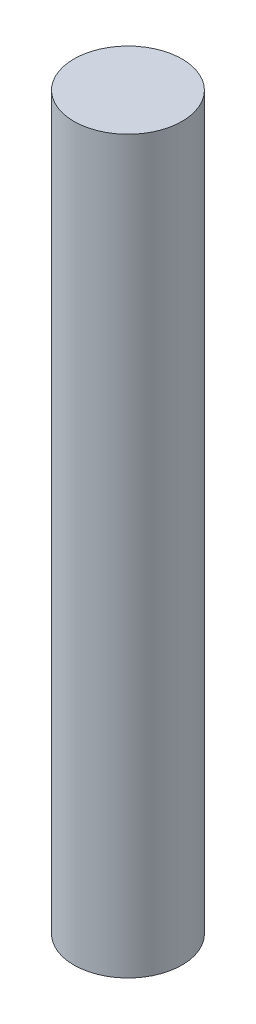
ISO-10303-21;
HEADER;
FILE_DESCRIPTION(('STEP AP214'),'2;1');
FILE_NAME('part.step','',(''),(''),'','','');
FILE_SCHEMA(('AUTOMOTIVE_DESIGN { 1 0 10303 214 1 1 1 1 }'));
ENDSEC;
DATA;
#1=APPLICATION_CONTEXT('core data for automotive mechanical design processes');
#2=APPLICATION_PROTOCOL_DEFINITION('international standard','automotive_design',2000,#1);
#3=PRODUCT_CONTEXT('',#1,'mechanical');
#4=PRODUCT('Part','Part','',(#3));
#5=PRODUCT_RELATED_PRODUCT_CATEGORY('part','',(#4));
#6=PRODUCT_DEFINITION_FORMATION('','',#4);
#7=PRODUCT_DEFINITION_CONTEXT('part definition',#1,'design');
#8=PRODUCT_DEFINITION('design','',#6,#7);
#9=PRODUCT_DEFINITION_SHAPE('','',#8);
#10=(LENGTH_UNIT() NAMED_UNIT(*) SI_UNIT(.MILLI.,.METRE.));
#11=(NAMED_UNIT(*) PLANE_ANGLE_UNIT() SI_UNIT($,.RADIAN.));
#12=(NAMED_UNIT(*) SI_UNIT($,.STERADIAN.) SOLID_ANGLE_UNIT());
#13=UNCERTAINTY_MEASURE_WITH_UNIT(LENGTH_MEASURE(1.E-05),#10,'distance_accuracy_value','');
#14=(GEOMETRIC_REPRESENTATION_CONTEXT(3) GLOBAL_UNCERTAINTY_ASSIGNED_CONTEXT((#13)) GLOBAL_UNIT_ASSIGNED_CONTEXT((#10,
#11,#12)) REPRESENTATION_CONTEXT('',''));
#15=CARTESIAN_POINT('',(0.,0.,0.));
#16=DIRECTION('',(0.,0.,1.));
#17=DIRECTION('',(1.,0.,0.));
#18=AXIS2_PLACEMENT_3D('',#15,#16,#17);
#19=CARTESIAN_POINT('',(0.,25.,0.));
#20=DIRECTION('',(0.,-1.,0.));
#21=DIRECTION('',(0.,0.,-1.));
#22=AXIS2_PLACEMENT_3D('',#19,#20,#21);
#23=CYLINDRICAL_SURFACE('',#22,1.85);
#24=CARTESIAN_POINT('',(0.,25.,0.));
#25=DIRECTION('',(0.,1.,0.));
#26=DIRECTION('',(0.,0.,1.));
#27=AXIS2_PLACEMENT_3D('',#24,#25,#26);
#28=CIRCLE('',#27,1.85);
#29=CARTESIAN_POINT('',(0.,25.,1.85));
#30=VERTEX_POINT('',#29);
#31=EDGE_CURVE('E10',#30,#30,#28,.T.);
#32=ORIENTED_EDGE('',*,*,#31,.F.);
#33=EDGE_LOOP('',(#32));
#34=FACE_BOUND('',#33,.T.);
#35=CARTESIAN_POINT('',(0.,0.,0.));
#36=DIRECTION('',(0.,1.,0.));
#37=DIRECTION('',(0.,0.,1.));
#38=AXIS2_PLACEMENT_3D('',#35,#36,#37);
#39=CIRCLE('',#38,1.85);
#40=CARTESIAN_POINT('',(0.,0.,1.85));
#41=VERTEX_POINT('',#40);
#42=EDGE_CURVE('E36',#41,#41,#39,.T.);
#43=ORIENTED_EDGE('',*,*,#42,.T.);
#44=EDGE_LOOP('',(#43));
#45=FACE_BOUND('',#44,.T.);
#46=ADVANCED_FACE('F33',(#34,#45),#23,.T.);
#47=CARTESIAN_POINT('',(0.,25.,0.));
#48=DIRECTION('',(0.,1.,0.));
#49=DIRECTION('',(0.,0.,1.));
#50=AXIS2_PLACEMENT_3D('',#47,#48,#49);
#51=PLANE('',#50);
#52=ORIENTED_EDGE('',*,*,#31,.T.);
#53=EDGE_LOOP('',(#52));
#54=FACE_BOUND('',#53,.T.);
#55=ADVANCED_FACE('F48',(#54),#51,.T.);
#56=CARTESIAN_POINT('',(0.,0.,0.));
#57=DIRECTION('',(0.,1.,0.));
#58=DIRECTION('',(0.,0.,1.));
#59=AXIS2_PLACEMENT_3D('',#56,#57,#58);
#60=PLANE('',#59);
#61=ORIENTED_EDGE('',*,*,#42,.F.);
#62=EDGE_LOOP('',(#61));
#63=FACE_BOUND('',#62,.T.);
#64=ADVANCED_FACE('F46',(#63),#60,.F.);
#65=CLOSED_SHELL('',(#46,#55,#64));
#66=MANIFOLD_SOLID_BREP('B2',#65);
#67=ADVANCED_BREP_SHAPE_REPRESENTATION('',(#18,#66),#14);
#68=SHAPE_DEFINITION_REPRESENTATION(#9,#67);
ENDSEC;
END-ISO-10303-21;
